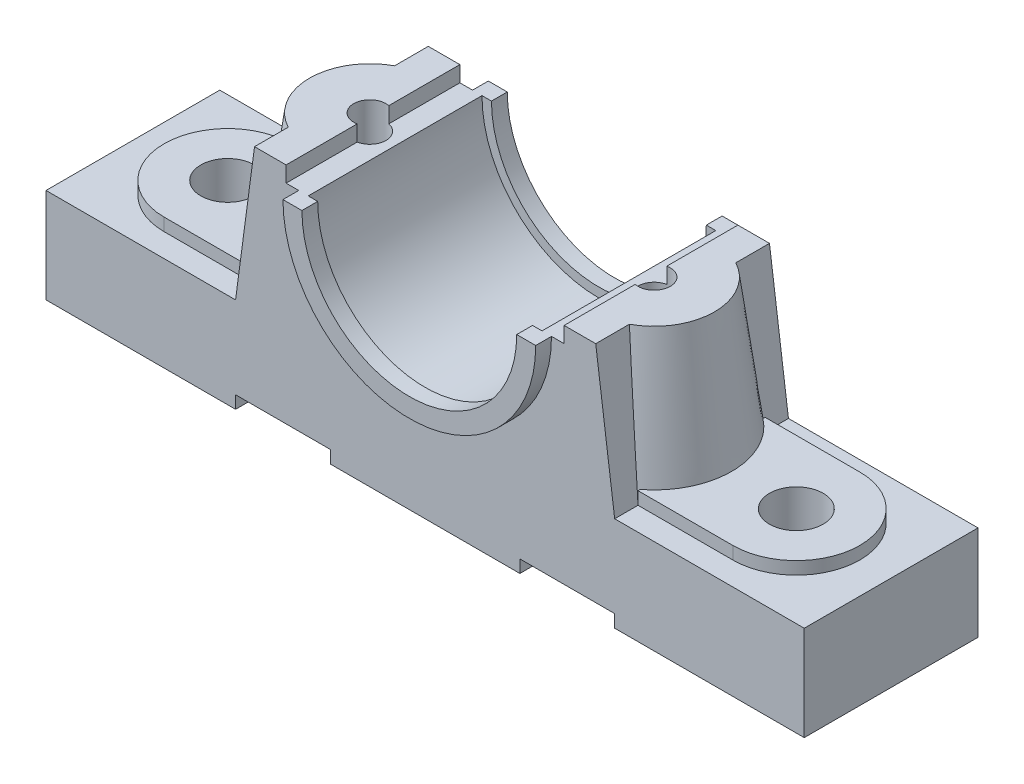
from build123d import *

# Parameters (mm, degrees)
EXTRUDE_1_DEPTH     = 27.5
EXTRUDE_2_DEPTH     = 4
SKETCH_4_R          = 8.5
CUT_EXTRUDE_1_DEPTH = 130.758429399
CUT_EXTRUDE_2_DEPTH = 27.5
EXTRUDE_3_DEPTH     = 32.5
CUT_EXTRUDE_3_DEPTH = 27.5
HOLE_WIZARD_M12_1_D = 10.2
SKETCH_12_W         = 30
SKETCH_12_H         = 15
CUT_EXTRUDE_4_DEPTH = 15


with BuildPart() as part:
    # Sketch 1 → Extrude 1 (new, symmetric)
    with BuildSketch(Plane.XY):
        Polygon((0, 0), (-30, 0), (-30, 4), (-60, 4), (-60, 0), (-120, 0), (-120, 30), (-60, 30), (-54, 75), (0, 75), align=None)
    extrude(amount=EXTRUDE_1_DEPTH, both=True)

    # Sketch 2 → Revolve 1 (revolve)
    with BuildSketch(Plane.XY):
        Polygon((-45, 30), (-70.0884973, 30), (-64.0884973, 75), (-45, 75), align=None)
    revolve(axis=Axis((-45, -39.894636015, 0), (0, 1, 0)))

    # Sketch 3 → Extrude 2 (add)
    with BuildSketch(Plane(origin=(0, 30, 0), x_dir=(1, 0, 0), z_dir=(0, 1, 0))):
        with BuildLine():
            Line((-60, 20.110512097), (-90, 20.110512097))
            ThreePointArc((-90, 20.110512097), (-110.110512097, 0), (-90, -20.110512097))
            Line((-90, -20.110512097), (-60, -20.110512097))
            Line((-60, -20.110512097), (-60, 20.110512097))
        make_face()
    extrude(amount=EXTRUDE_2_DEPTH)

    # Sketch 4 → Cut-Extrude 1 (cut, through all)
    with BuildSketch(Plane(origin=(0, 34, 0), x_dir=(1, 0, 0), z_dir=(0, 1, 0))):
        with Locations(Location((-90, 0, 0), (0, 0, 180))):
            Circle(SKETCH_4_R)
    extrude(amount=-CUT_EXTRUDE_1_DEPTH, mode=Mode.SUBTRACT)

    # Sketch 5 → Cut-Extrude 2 (cut, symmetric)
    with BuildSketch(Plane.XY):
        with BuildLine():
            Line((-40, 70), (-44, 70))
            Line((-44, 70), (-44, 75))
            Line((-44, 75), (0, 75))
            Line((0, 75), (0, 30))
            ThreePointArc((0, 30), (-28.284271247, 41.715728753), (-40, 70))
        make_face()
    extrude(amount=CUT_EXTRUDE_2_DEPTH, both=True, mode=Mode.SUBTRACT)

    # Sketch 6 → Extrude 3 (add, symmetric)
    with BuildSketch(Plane.XY):
        with BuildLine():
            Line((-40, 70), (-34, 70))
            ThreePointArc((-34, 70), (-24.04163056, 45.95836944), (0, 36))
            Line((0, 36), (0, 30))
            ThreePointArc((0, 30), (-28.284271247, 41.715728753), (-40, 70))
        make_face()
    extrude(amount=EXTRUDE_3_DEPTH, both=True)

    # Sketch 7 → Cut-Extrude 3 (cut, symmetric)
    with BuildSketch(Plane.XY):
        with BuildLine():
            Line((-37, 70), (-34, 70))
            ThreePointArc((-34, 70), (-24.04163056, 45.95836944), (0, 36))
            Line((0, 36), (0, 33))
            ThreePointArc((0, 33), (-26.162950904, 43.837049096), (-37, 70))
        make_face()
    extrude(amount=CUT_EXTRUDE_3_DEPTH, both=True, mode=Mode.SUBTRACT)

    # Hole Wizard M12 _1 (through all)
    with Locations(Plane(origin=(0, 75, 0), x_dir=(-1, 0, 0), z_dir=(0, 1, 0))):
        with Locations((45, 0)):
            Hole(HOLE_WIZARD_M12_1_D / 2)

    # Sketch 12 → Cut-Extrude 4 (cut, symmetric)
    with BuildSketch(Plane.XY):
        with Locations((-45, 7.5)):
            Rectangle(SKETCH_12_W, SKETCH_12_H)
    extrude(amount=CUT_EXTRUDE_4_DEPTH, both=True, mode=Mode.SUBTRACT)

    # Mirror 3: part across plane


with BuildPart() as part_1:
    add(part.part)
    add(part.part.mirror(Plane(origin=(0, 75, 27.5), x_dir=(0, 0, 1), z_dir=(-1, 0, 0))))


solid = part_1.part
